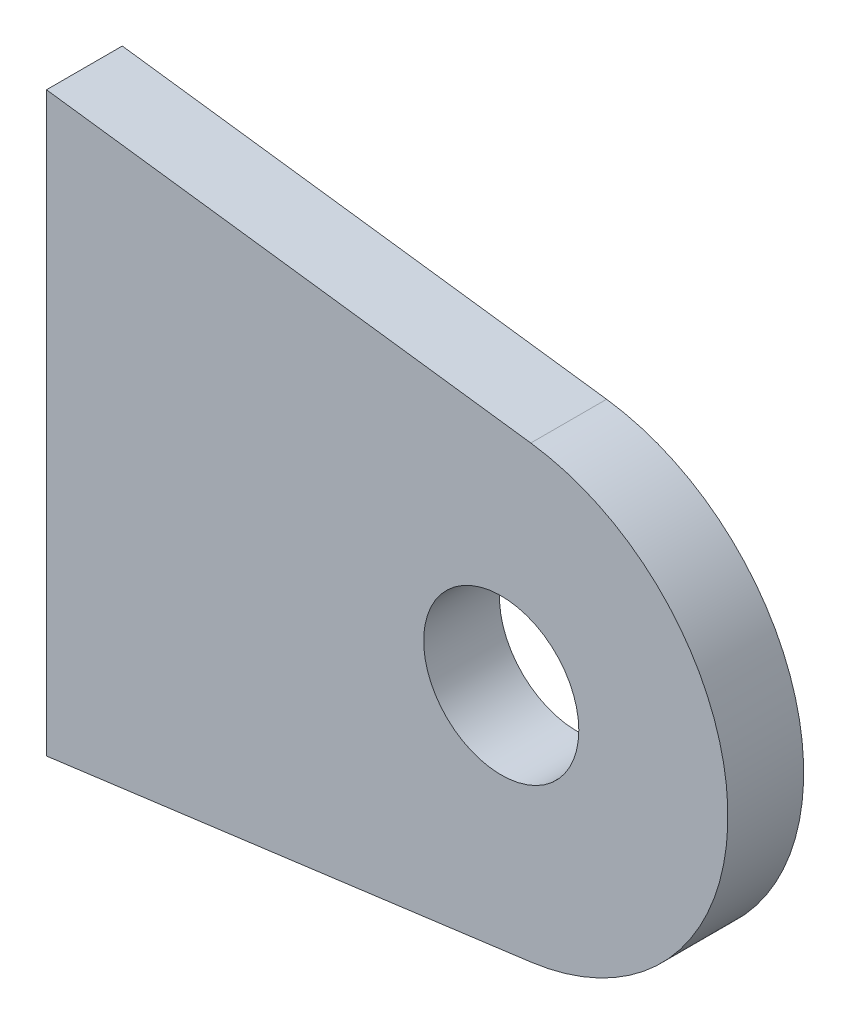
ISO-10303-21;
HEADER;
FILE_DESCRIPTION(('STEP AP214'),'2;1');
FILE_NAME('part.step','',(''),(''),'','','');
FILE_SCHEMA(('AUTOMOTIVE_DESIGN { 1 0 10303 214 1 1 1 1 }'));
ENDSEC;
DATA;
#1=APPLICATION_CONTEXT('core data for automotive mechanical design processes');
#2=APPLICATION_PROTOCOL_DEFINITION('international standard','automotive_design',2000,#1);
#3=PRODUCT_CONTEXT('',#1,'mechanical');
#4=PRODUCT('Part','Part','',(#3));
#5=PRODUCT_RELATED_PRODUCT_CATEGORY('part','',(#4));
#6=PRODUCT_DEFINITION_FORMATION('','',#4);
#7=PRODUCT_DEFINITION_CONTEXT('part definition',#1,'design');
#8=PRODUCT_DEFINITION('design','',#6,#7);
#9=PRODUCT_DEFINITION_SHAPE('','',#8);
#10=(LENGTH_UNIT() NAMED_UNIT(*) SI_UNIT(.MILLI.,.METRE.));
#11=(NAMED_UNIT(*) PLANE_ANGLE_UNIT() SI_UNIT($,.RADIAN.));
#12=(NAMED_UNIT(*) SI_UNIT($,.STERADIAN.) SOLID_ANGLE_UNIT());
#13=UNCERTAINTY_MEASURE_WITH_UNIT(LENGTH_MEASURE(1.E-05),#10,'distance_accuracy_value','');
#14=(GEOMETRIC_REPRESENTATION_CONTEXT(3) GLOBAL_UNCERTAINTY_ASSIGNED_CONTEXT((#13)) GLOBAL_UNIT_ASSIGNED_CONTEXT((#10,
#11,#12)) REPRESENTATION_CONTEXT('',''));
#15=CARTESIAN_POINT('',(0.,0.,0.));
#16=DIRECTION('',(0.,0.,1.));
#17=DIRECTION('',(1.,0.,0.));
#18=AXIS2_PLACEMENT_3D('',#15,#16,#17);
#19=CARTESIAN_POINT('',(1.23946787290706,-9.41469319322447,3.17499999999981));
#20=DIRECTION('',(0.130526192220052,-0.99144486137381,0.));
#21=DIRECTION('',(0.99144486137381,0.130526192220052,0.));
#22=AXIS2_PLACEMENT_3D('',#19,#20,#21);
#23=PLANE('',#22);
#24=DIRECTION('',(-0.99144486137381,-0.130526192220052,0.));
#25=VECTOR('',#24,1.);
#26=CARTESIAN_POINT('',(1.23946787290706,-9.41469319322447,-1.94289029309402E-13));
#27=LINE('',#26,#25);
#28=CARTESIAN_POINT('',(1.23946787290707,-9.41469319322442,-1.94289029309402E-13));
#29=VERTEX_POINT('',#28);
#30=CARTESIAN_POINT('',(-19.05,-12.0858523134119,-1.94289029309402E-13));
#31=VERTEX_POINT('',#30);
#32=EDGE_CURVE('E118',#29,#31,#27,.T.);
#33=ORIENTED_EDGE('',*,*,#32,.F.);
#34=DIRECTION('',(0.,0.,-1.));
#35=VECTOR('',#34,1.);
#36=CARTESIAN_POINT('',(1.23946787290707,-9.41469319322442,3.17499999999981));
#37=LINE('',#36,#35);
#38=CARTESIAN_POINT('',(1.23946787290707,-9.41469319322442,3.17499999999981));
#39=VERTEX_POINT('',#38);
#40=EDGE_CURVE('E11',#39,#29,#37,.T.);
#41=ORIENTED_EDGE('',*,*,#40,.F.);
#42=DIRECTION('',(-0.99144486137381,-0.130526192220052,0.));
#43=VECTOR('',#42,1.);
#44=CARTESIAN_POINT('',(1.23946787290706,-9.41469319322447,3.17499999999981));
#45=LINE('',#44,#43);
#46=CARTESIAN_POINT('',(-19.05,-12.0858523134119,3.17499999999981));
#47=VERTEX_POINT('',#46);
#48=EDGE_CURVE('E95',#39,#47,#45,.T.);
#49=ORIENTED_EDGE('',*,*,#48,.T.);
#50=DIRECTION('',(0.,0.,-1.));
#51=VECTOR('',#50,1.);
#52=CARTESIAN_POINT('',(-19.05,-12.0858523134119,3.17499999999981));
#53=LINE('',#52,#51);
#54=EDGE_CURVE('E62',#47,#31,#53,.T.);
#55=ORIENTED_EDGE('',*,*,#54,.T.);
#56=EDGE_LOOP('',(#33,#41,#49,#55));
#57=FACE_BOUND('',#56,.T.);
#58=ADVANCED_FACE('F45',(#57),#23,.T.);
#59=CARTESIAN_POINT('',(0.,0.,3.17499999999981));
#60=DIRECTION('',(0.,0.,-1.));
#61=DIRECTION('',(-1.,0.,0.));
#62=AXIS2_PLACEMENT_3D('',#59,#60,#61);
#63=CYLINDRICAL_SURFACE('',#62,9.49593220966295);
#64=CARTESIAN_POINT('',(0.,0.,-1.94289029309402E-13));
#65=DIRECTION('',(0.,0.,1.));
#66=DIRECTION('',(1.,0.,0.));
#67=AXIS2_PLACEMENT_3D('',#64,#65,#66);
#68=CIRCLE('',#67,9.49593220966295);
#69=CARTESIAN_POINT('',(1.23946787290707,9.41469319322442,-1.94289029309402E-13));
#70=VERTEX_POINT('',#69);
#71=EDGE_CURVE('E102',#29,#70,#68,.T.);
#72=ORIENTED_EDGE('',*,*,#71,.T.);
#73=DIRECTION('',(0.,0.,-1.));
#74=VECTOR('',#73,1.);
#75=CARTESIAN_POINT('',(1.23946787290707,9.41469319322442,3.17499999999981));
#76=LINE('',#75,#74);
#77=CARTESIAN_POINT('',(1.23946787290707,9.41469319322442,3.17499999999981));
#78=VERTEX_POINT('',#77);
#79=EDGE_CURVE('E54',#78,#70,#76,.T.);
#80=ORIENTED_EDGE('',*,*,#79,.F.);
#81=CARTESIAN_POINT('',(0.,0.,3.17499999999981));
#82=DIRECTION('',(0.,0.,1.));
#83=DIRECTION('',(1.,0.,0.));
#84=AXIS2_PLACEMENT_3D('',#81,#82,#83);
#85=CIRCLE('',#84,9.49593220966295);
#86=EDGE_CURVE('E88',#39,#78,#85,.T.);
#87=ORIENTED_EDGE('',*,*,#86,.F.);
#88=ORIENTED_EDGE('',*,*,#40,.T.);
#89=EDGE_LOOP('',(#72,#80,#87,#88));
#90=FACE_BOUND('',#89,.T.);
#91=ADVANCED_FACE('F100',(#90),#63,.T.);
#92=CARTESIAN_POINT('',(1.23946787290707,9.41469319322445,3.17499999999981));
#93=DIRECTION('',(-0.130526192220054,-0.99144486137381,0.));
#94=DIRECTION('',(0.99144486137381,-0.130526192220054,0.));
#95=AXIS2_PLACEMENT_3D('',#92,#93,#94);
#96=PLANE('',#95);
#97=DIRECTION('',(-0.99144486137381,0.130526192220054,0.));
#98=VECTOR('',#97,1.);
#99=CARTESIAN_POINT('',(1.23946787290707,9.41469319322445,-1.94289029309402E-13));
#100=LINE('',#99,#98);
#101=CARTESIAN_POINT('',(-19.05,12.0858523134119,-1.94289029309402E-13));
#102=VERTEX_POINT('',#101);
#103=EDGE_CURVE('E123',#70,#102,#100,.T.);
#104=ORIENTED_EDGE('',*,*,#103,.T.);
#105=DIRECTION('',(0.,0.,-1.));
#106=VECTOR('',#105,1.);
#107=CARTESIAN_POINT('',(-19.05,12.0858523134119,3.17499999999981));
#108=LINE('',#107,#106);
#109=CARTESIAN_POINT('',(-19.05,12.0858523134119,3.17499999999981));
#110=VERTEX_POINT('',#109);
#111=EDGE_CURVE('E76',#110,#102,#108,.T.);
#112=ORIENTED_EDGE('',*,*,#111,.F.);
#113=DIRECTION('',(-0.99144486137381,0.130526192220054,0.));
#114=VECTOR('',#113,1.);
#115=CARTESIAN_POINT('',(1.23946787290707,9.41469319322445,3.17499999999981));
#116=LINE('',#115,#114);
#117=EDGE_CURVE('E94',#78,#110,#116,.T.);
#118=ORIENTED_EDGE('',*,*,#117,.F.);
#119=ORIENTED_EDGE('',*,*,#79,.T.);
#120=EDGE_LOOP('',(#104,#112,#118,#119));
#121=FACE_BOUND('',#120,.T.);
#122=ADVANCED_FACE('F106',(#121),#96,.F.);
#123=CARTESIAN_POINT('',(-19.05,0.,3.17499999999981));
#124=DIRECTION('',(-1.,0.,0.));
#125=DIRECTION('',(0.,0.,1.));
#126=AXIS2_PLACEMENT_3D('',#123,#124,#125);
#127=PLANE('',#126);
#128=DIRECTION('',(0.,1.,0.));
#129=VECTOR('',#128,1.);
#130=CARTESIAN_POINT('',(-19.05,0.,-1.94289029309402E-13));
#131=LINE('',#130,#129);
#132=EDGE_CURVE('E126',#31,#102,#131,.T.);
#133=ORIENTED_EDGE('',*,*,#132,.F.);
#134=ORIENTED_EDGE('',*,*,#54,.F.);
#135=DIRECTION('',(0.,1.,0.));
#136=VECTOR('',#135,1.);
#137=CARTESIAN_POINT('',(-19.05,0.,3.17499999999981));
#138=LINE('',#137,#136);
#139=EDGE_CURVE('E108',#47,#110,#138,.T.);
#140=ORIENTED_EDGE('',*,*,#139,.T.);
#141=ORIENTED_EDGE('',*,*,#111,.T.);
#142=EDGE_LOOP('',(#133,#134,#140,#141));
#143=FACE_BOUND('',#142,.T.);
#144=ADVANCED_FACE('F140',(#143),#127,.T.);
#145=CARTESIAN_POINT('',(0.,0.,3.17499999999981));
#146=DIRECTION('',(0.,0.,-1.));
#147=DIRECTION('',(-1.,0.,0.));
#148=AXIS2_PLACEMENT_3D('',#145,#146,#147);
#149=CYLINDRICAL_SURFACE('',#148,3.24999999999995);
#150=CARTESIAN_POINT('',(0.,0.,3.17499999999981));
#151=DIRECTION('',(0.,0.,1.));
#152=DIRECTION('',(1.,0.,0.));
#153=AXIS2_PLACEMENT_3D('',#150,#151,#152);
#154=CIRCLE('',#153,3.24999999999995);
#155=CARTESIAN_POINT('',(3.24999999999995,0.,3.17499999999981));
#156=VERTEX_POINT('',#155);
#157=EDGE_CURVE('E111',#156,#156,#154,.T.);
#158=ORIENTED_EDGE('',*,*,#157,.T.);
#159=EDGE_LOOP('',(#158));
#160=FACE_BOUND('',#159,.T.);
#161=CARTESIAN_POINT('',(0.,0.,-1.94289029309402E-13));
#162=DIRECTION('',(0.,0.,1.));
#163=DIRECTION('',(1.,0.,0.));
#164=AXIS2_PLACEMENT_3D('',#161,#162,#163);
#165=CIRCLE('',#164,3.24999999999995);
#166=CARTESIAN_POINT('',(3.24999999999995,0.,-1.94289029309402E-13));
#167=VERTEX_POINT('',#166);
#168=EDGE_CURVE('E130',#167,#167,#165,.T.);
#169=ORIENTED_EDGE('',*,*,#168,.F.);
#170=EDGE_LOOP('',(#169));
#171=FACE_BOUND('',#170,.T.);
#172=ADVANCED_FACE('F142',(#160,#171),#149,.F.);
#173=CARTESIAN_POINT('',(0.,0.,3.17499999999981));
#174=DIRECTION('',(0.,0.,1.));
#175=DIRECTION('',(1.,0.,0.));
#176=AXIS2_PLACEMENT_3D('',#173,#174,#175);
#177=PLANE('',#176);
#178=ORIENTED_EDGE('',*,*,#48,.F.);
#179=ORIENTED_EDGE('',*,*,#86,.T.);
#180=ORIENTED_EDGE('',*,*,#117,.T.);
#181=ORIENTED_EDGE('',*,*,#139,.F.);
#182=EDGE_LOOP('',(#178,#179,#180,#181));
#183=FACE_BOUND('',#182,.T.);
#184=ORIENTED_EDGE('',*,*,#157,.F.);
#185=EDGE_LOOP('',(#184));
#186=FACE_BOUND('',#185,.T.);
#187=ADVANCED_FACE('F90',(#183,#186),#177,.T.);
#188=CARTESIAN_POINT('',(0.,0.,-1.94289029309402E-13));
#189=DIRECTION('',(0.,0.,1.));
#190=DIRECTION('',(1.,0.,0.));
#191=AXIS2_PLACEMENT_3D('',#188,#189,#190);
#192=PLANE('',#191);
#193=ORIENTED_EDGE('',*,*,#32,.T.);
#194=ORIENTED_EDGE('',*,*,#132,.T.);
#195=ORIENTED_EDGE('',*,*,#103,.F.);
#196=ORIENTED_EDGE('',*,*,#71,.F.);
#197=EDGE_LOOP('',(#193,#194,#195,#196));
#198=FACE_BOUND('',#197,.T.);
#199=ORIENTED_EDGE('',*,*,#168,.T.);
#200=EDGE_LOOP('',(#199));
#201=FACE_BOUND('',#200,.T.);
#202=ADVANCED_FACE('F174',(#198,#201),#192,.F.);
#203=CLOSED_SHELL('',(#58,#91,#122,#144,#172,#187,#202));
#204=MANIFOLD_SOLID_BREP('B2',#203);
#205=ADVANCED_BREP_SHAPE_REPRESENTATION('',(#18,#204),#14);
#206=SHAPE_DEFINITION_REPRESENTATION(#9,#205);
ENDSEC;
END-ISO-10303-21;
